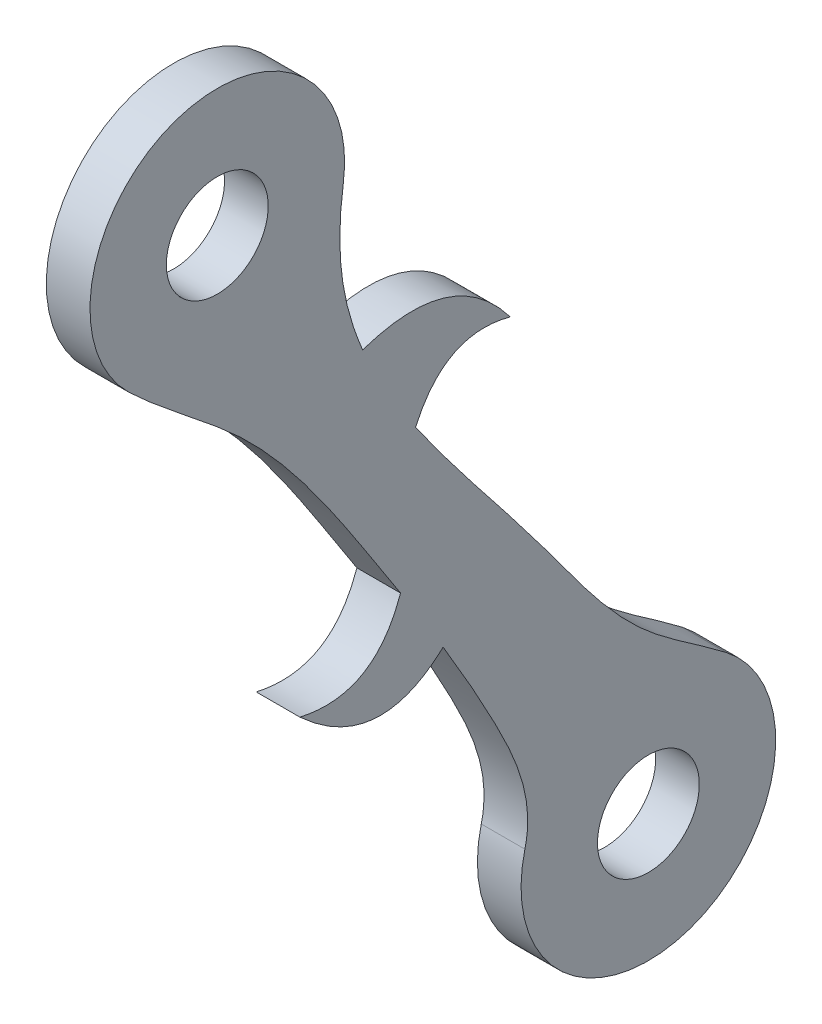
ISO-10303-21;
HEADER;
FILE_DESCRIPTION(('STEP AP214'),'2;1');
FILE_NAME('part.step','',(''),(''),'','','');
FILE_SCHEMA(('AUTOMOTIVE_DESIGN { 1 0 10303 214 1 1 1 1 }'));
ENDSEC;
DATA;
#1=APPLICATION_CONTEXT('core data for automotive mechanical design processes');
#2=APPLICATION_PROTOCOL_DEFINITION('international standard','automotive_design',2000,#1);
#3=PRODUCT_CONTEXT('',#1,'mechanical');
#4=PRODUCT('Part','Part','',(#3));
#5=PRODUCT_RELATED_PRODUCT_CATEGORY('part','',(#4));
#6=PRODUCT_DEFINITION_FORMATION('','',#4);
#7=PRODUCT_DEFINITION_CONTEXT('part definition',#1,'design');
#8=PRODUCT_DEFINITION('design','',#6,#7);
#9=PRODUCT_DEFINITION_SHAPE('','',#8);
#10=(LENGTH_UNIT() NAMED_UNIT(*) SI_UNIT(.MILLI.,.METRE.));
#11=(NAMED_UNIT(*) PLANE_ANGLE_UNIT() SI_UNIT($,.RADIAN.));
#12=(NAMED_UNIT(*) SI_UNIT($,.STERADIAN.) SOLID_ANGLE_UNIT());
#13=UNCERTAINTY_MEASURE_WITH_UNIT(LENGTH_MEASURE(1.E-05),#10,'distance_accuracy_value','');
#14=(GEOMETRIC_REPRESENTATION_CONTEXT(3) GLOBAL_UNCERTAINTY_ASSIGNED_CONTEXT((#13)) GLOBAL_UNIT_ASSIGNED_CONTEXT((#10,
#11,#12)) REPRESENTATION_CONTEXT('',''));
#15=CARTESIAN_POINT('',(0.,0.,0.));
#16=DIRECTION('',(0.,0.,1.));
#17=DIRECTION('',(1.,0.,0.));
#18=AXIS2_PLACEMENT_3D('',#15,#16,#17);
#19=CARTESIAN_POINT('',(-1.36819748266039,-0.277107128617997,67.7394060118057));
#20=CARTESIAN_POINT('',(-1.36819748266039,4.24847828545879,65.7155312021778));
#21=CARTESIAN_POINT('',(-1.36819748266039,3.03182089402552,61.2299207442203));
#22=B_SPLINE_CURVE_WITH_KNOTS('',2,(#19,#20,#21),.UNSPECIFIED.,.F.,.F.,(3,3),(0.,1.),.UNSPECIFIED.);
#23=DIRECTION('',(1.,0.,0.));
#24=VECTOR('',#23,1.);
#25=SURFACE_OF_LINEAR_EXTRUSION('',#22,#24);
#26=DIRECTION('',(-1.,0.,0.));
#27=VECTOR('',#26,1.);
#28=CARTESIAN_POINT('',(-1.36819748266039,3.03182089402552,61.2299207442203));
#29=LINE('',#28,#27);
#30=CARTESIAN_POINT('',(1.63180251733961,3.03182089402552,61.2299207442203));
#31=VERTEX_POINT('',#30);
#32=CARTESIAN_POINT('',(-1.36819748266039,3.03182089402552,61.2299207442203));
#33=VERTEX_POINT('',#32);
#34=EDGE_CURVE('E11',#31,#33,#29,.T.);
#35=ORIENTED_EDGE('',*,*,#34,.F.);
#36=CARTESIAN_POINT('',(1.63180251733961,-0.277107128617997,67.7394060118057));
#37=CARTESIAN_POINT('',(1.63180251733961,4.24847828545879,65.7155312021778));
#38=CARTESIAN_POINT('',(1.63180251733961,3.03182089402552,61.2299207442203));
#39=B_SPLINE_CURVE_WITH_KNOTS('',2,(#36,#37,#38),.UNSPECIFIED.,.F.,.F.,(3,3),(0.,1.),.UNSPECIFIED.);
#40=CARTESIAN_POINT('',(1.63180251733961,-0.27710712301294,67.7394060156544));
#41=VERTEX_POINT('',#40);
#42=EDGE_CURVE('E115',#41,#31,#39,.T.);
#43=ORIENTED_EDGE('',*,*,#42,.F.);
#44=DIRECTION('',(-1.,0.,0.));
#45=VECTOR('',#44,1.);
#46=CARTESIAN_POINT('',(-1.36819748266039,-0.27710712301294,67.7394060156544));
#47=LINE('',#46,#45);
#48=CARTESIAN_POINT('',(-1.36819748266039,-0.27710712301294,67.7394060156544));
#49=VERTEX_POINT('',#48);
#50=EDGE_CURVE('E52',#41,#49,#47,.T.);
#51=ORIENTED_EDGE('',*,*,#50,.T.);
#52=EDGE_CURVE('E210',#49,#33,#22,.T.);
#53=ORIENTED_EDGE('',*,*,#52,.T.);
#54=EDGE_LOOP('',(#35,#43,#51,#53));
#55=FACE_BOUND('',#54,.T.);
#56=ADVANCED_FACE('F41',(#55),#25,.T.);
#57=CARTESIAN_POINT('',(-1.36819748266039,16.6690822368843,72.7114555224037));
#58=CARTESIAN_POINT('',(-1.36819748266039,14.3923445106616,73.0487176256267));
#59=CARTESIAN_POINT('',(-1.36819748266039,7.94477005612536,72.9992097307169));
#60=CARTESIAN_POINT('',(-1.36819748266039,-1.71894822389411,67.1466798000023));
#61=CARTESIAN_POINT('',(-1.36819748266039,-10.9949276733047,59.275806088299));
#62=CARTESIAN_POINT('',(-1.36819748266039,-19.8573073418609,53.3835257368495));
#63=CARTESIAN_POINT('',(-1.36819748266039,-22.9678598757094,48.1902649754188));
#64=CARTESIAN_POINT('',(-1.36819748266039,-24.3590829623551,46.3908015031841));
#65=B_SPLINE_CURVE_WITH_KNOTS('',3,(#57,#58,#59,#60,#61,#62,#63,#64),.UNSPECIFIED.,.F.,.F.,(4,1,
1,1,1,4),(0.,0.13028049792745,0.385599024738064,0.63779392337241,0.868172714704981,1.),.UNSPECIFIED.);
#66=DIRECTION('',(1.,0.,0.));
#67=VECTOR('',#66,1.);
#68=SURFACE_OF_LINEAR_EXTRUSION('',#65,#67);
#69=ORIENTED_EDGE('',*,*,#50,.F.);
#70=CARTESIAN_POINT('',(1.63180251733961,16.6690822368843,72.7114555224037));
#71=CARTESIAN_POINT('',(1.63180251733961,14.3923445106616,73.0487176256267));
#72=CARTESIAN_POINT('',(1.63180251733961,7.94477005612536,72.9992097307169));
#73=CARTESIAN_POINT('',(1.63180251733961,-1.71894822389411,67.1466798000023));
#74=CARTESIAN_POINT('',(1.63180251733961,-10.9949276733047,59.275806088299));
#75=CARTESIAN_POINT('',(1.63180251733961,-19.8573073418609,53.3835257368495));
#76=CARTESIAN_POINT('',(1.63180251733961,-22.9678598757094,48.1902649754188));
#77=CARTESIAN_POINT('',(1.63180251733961,-24.3590829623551,46.3908015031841));
#78=B_SPLINE_CURVE_WITH_KNOTS('',3,(#70,#71,#72,#73,#74,#75,#76,#77),.UNSPECIFIED.,.F.,.F.,(4,1,
1,1,1,4),(0.,0.13028049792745,0.385599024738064,0.63779392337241,0.868172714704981,1.),.UNSPECIFIED.);
#79=CARTESIAN_POINT('',(1.63180251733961,-24.3590829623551,46.3908015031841));
#80=VERTEX_POINT('',#79);
#81=EDGE_CURVE('E169',#41,#80,#78,.T.);
#82=ORIENTED_EDGE('',*,*,#81,.T.);
#83=DIRECTION('',(-1.,0.,0.));
#84=VECTOR('',#83,1.);
#85=CARTESIAN_POINT('',(-1.36819748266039,-24.3590829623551,46.3908015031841));
#86=LINE('',#85,#84);
#87=CARTESIAN_POINT('',(-1.36819748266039,-24.3590829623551,46.3908015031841));
#88=VERTEX_POINT('',#87);
#89=EDGE_CURVE('E203',#80,#88,#86,.T.);
#90=ORIENTED_EDGE('',*,*,#89,.T.);
#91=EDGE_CURVE('E219',#49,#88,#65,.T.);
#92=ORIENTED_EDGE('',*,*,#91,.F.);
#93=EDGE_LOOP('',(#69,#82,#90,#92));
#94=FACE_BOUND('',#93,.T.);
#95=ADVANCED_FACE('F222',(#94),#68,.F.);
#96=CARTESIAN_POINT('',(-1.36819748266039,-31.2814704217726,51.7427218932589));
#97=DIRECTION('',(1.,0.,0.));
#98=DIRECTION('',(0.,0.,-1.));
#99=AXIS2_PLACEMENT_3D('',#96,#97,#98);
#100=CYLINDRICAL_SURFACE('',#99,8.74999999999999);
#101=ORIENTED_EDGE('',*,*,#89,.F.);
#102=CARTESIAN_POINT('',(1.63180251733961,-31.2814704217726,51.7427218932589));
#103=DIRECTION('',(1.,0.,0.));
#104=DIRECTION('',(0.,0.,-1.));
#105=AXIS2_PLACEMENT_3D('',#102,#103,#104);
#106=CIRCLE('',#105,8.74999999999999);
#107=CARTESIAN_POINT('',(1.63180251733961,-29.146619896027,60.2282927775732));
#108=VERTEX_POINT('',#107);
#109=EDGE_CURVE('E163',#108,#80,#106,.T.);
#110=ORIENTED_EDGE('',*,*,#109,.F.);
#111=DIRECTION('',(-1.,0.,0.));
#112=VECTOR('',#111,1.);
#113=CARTESIAN_POINT('',(-1.36819748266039,-29.146619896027,60.2282927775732));
#114=LINE('',#113,#112);
#115=CARTESIAN_POINT('',(-1.36819748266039,-29.146619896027,60.2282927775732));
#116=VERTEX_POINT('',#115);
#117=EDGE_CURVE('E200',#108,#116,#114,.T.);
#118=ORIENTED_EDGE('',*,*,#117,.T.);
#119=CARTESIAN_POINT('',(-1.36819748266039,-31.2814704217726,51.7427218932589));
#120=DIRECTION('',(1.,0.,0.));
#121=DIRECTION('',(0.,0.,-1.));
#122=AXIS2_PLACEMENT_3D('',#119,#120,#121);
#123=CIRCLE('',#122,8.74999999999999);
#124=EDGE_CURVE('E223',#116,#88,#123,.T.);
#125=ORIENTED_EDGE('',*,*,#124,.T.);
#126=EDGE_LOOP('',(#101,#110,#118,#125));
#127=FACE_BOUND('',#126,.T.);
#128=ADVANCED_FACE('F247',(#127),#100,.T.);
#129=CARTESIAN_POINT('',(-1.36819748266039,11.6562345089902,87.4444308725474));
#130=CARTESIAN_POINT('',(-1.36819748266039,9.3969173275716,85.104219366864));
#131=CARTESIAN_POINT('',(-1.36819748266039,4.62647087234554,78.0280257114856));
#132=CARTESIAN_POINT('',(-1.36819748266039,-7.14790080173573,70.3702869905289));
#133=CARTESIAN_POINT('',(-1.36819748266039,-17.8652193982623,63.4388504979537));
#134=CARTESIAN_POINT('',(-1.36819748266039,-26.2772710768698,59.506404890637));
#135=CARTESIAN_POINT('',(-1.36819748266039,-29.146619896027,60.2282927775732));
#136=B_SPLINE_CURVE_WITH_KNOTS('',3,(#129,#130,#131,#132,#133,#134,#135),.UNSPECIFIED.,.F.,.F.,
(4,1,1,1,4),(0.,0.197057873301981,0.503182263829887,0.820257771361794,1.),.UNSPECIFIED.);
#137=DIRECTION('',(1.,0.,0.));
#138=VECTOR('',#137,1.);
#139=SURFACE_OF_LINEAR_EXTRUSION('',#136,#138);
#140=ORIENTED_EDGE('',*,*,#117,.F.);
#141=CARTESIAN_POINT('',(1.63180251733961,11.6562345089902,87.4444308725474));
#142=CARTESIAN_POINT('',(1.63180251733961,9.3969173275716,85.104219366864));
#143=CARTESIAN_POINT('',(1.63180251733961,4.62647087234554,78.0280257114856));
#144=CARTESIAN_POINT('',(1.63180251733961,-7.14790080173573,70.3702869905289));
#145=CARTESIAN_POINT('',(1.63180251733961,-17.8652193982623,63.4388504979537));
#146=CARTESIAN_POINT('',(1.63180251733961,-26.2772710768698,59.506404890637));
#147=CARTESIAN_POINT('',(1.63180251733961,-29.146619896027,60.2282927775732));
#148=B_SPLINE_CURVE_WITH_KNOTS('',3,(#141,#142,#143,#144,#145,#146,#147),.UNSPECIFIED.,.F.,.F.,
(4,1,1,1,4),(0.,0.197057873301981,0.503182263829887,0.820257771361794,1.),.UNSPECIFIED.);
#149=CARTESIAN_POINT('',(1.63180251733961,-14.3131740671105,65.8485051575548));
#150=VERTEX_POINT('',#149);
#151=EDGE_CURVE('E155',#150,#108,#148,.T.);
#152=ORIENTED_EDGE('',*,*,#151,.F.);
#153=DIRECTION('',(-1.,0.,0.));
#154=VECTOR('',#153,1.);
#155=CARTESIAN_POINT('',(-1.36819748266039,-14.3131740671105,65.8485051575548));
#156=LINE('',#155,#154);
#157=CARTESIAN_POINT('',(-1.36819748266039,-14.3131740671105,65.8485051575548));
#158=VERTEX_POINT('',#157);
#159=EDGE_CURVE('E197',#150,#158,#156,.T.);
#160=ORIENTED_EDGE('',*,*,#159,.T.);
#161=EDGE_CURVE('E225',#158,#116,#136,.T.);
#162=ORIENTED_EDGE('',*,*,#161,.T.);
#163=EDGE_LOOP('',(#140,#152,#160,#162));
#164=FACE_BOUND('',#163,.T.);
#165=ADVANCED_FACE('F250',(#164),#139,.T.);
#166=CARTESIAN_POINT('',(-1.36819748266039,-13.5584162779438,75.6906477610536));
#167=CARTESIAN_POINT('',(-1.36819748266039,-18.4852301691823,70.3379966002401));
#168=CARTESIAN_POINT('',(-1.36819748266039,-14.3131740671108,65.8485051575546));
#169=B_SPLINE_CURVE_WITH_KNOTS('',2,(#166,#167,#168),.UNSPECIFIED.,.F.,.F.,(3,3),(0.,1.),.UNSPECIFIED.);
#170=DIRECTION('',(1.,0.,0.));
#171=VECTOR('',#170,1.);
#172=SURFACE_OF_LINEAR_EXTRUSION('',#169,#171);
#173=ORIENTED_EDGE('',*,*,#159,.F.);
#174=CARTESIAN_POINT('',(1.63180251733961,-13.5584162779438,75.6906477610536));
#175=CARTESIAN_POINT('',(1.63180251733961,-18.4852301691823,70.3379966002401));
#176=CARTESIAN_POINT('',(1.63180251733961,-14.3131740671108,65.8485051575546));
#177=B_SPLINE_CURVE_WITH_KNOTS('',2,(#174,#175,#176),.UNSPECIFIED.,.F.,.F.,(3,3),(0.,1.),.UNSPECIFIED.);
#178=CARTESIAN_POINT('',(1.63180251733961,-13.5584162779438,75.6906477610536));
#179=VERTEX_POINT('',#178);
#180=EDGE_CURVE('E147',#179,#150,#177,.T.);
#181=ORIENTED_EDGE('',*,*,#180,.F.);
#182=DIRECTION('',(-1.,0.,0.));
#183=VECTOR('',#182,1.);
#184=CARTESIAN_POINT('',(-1.36819748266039,-13.5584162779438,75.6906477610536));
#185=LINE('',#184,#183);
#186=CARTESIAN_POINT('',(-1.36819748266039,-13.5584162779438,75.6906477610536));
#187=VERTEX_POINT('',#186);
#188=EDGE_CURVE('E194',#179,#187,#185,.T.);
#189=ORIENTED_EDGE('',*,*,#188,.T.);
#190=EDGE_CURVE('E259',#187,#158,#169,.T.);
#191=ORIENTED_EDGE('',*,*,#190,.T.);
#192=EDGE_LOOP('',(#173,#181,#189,#191));
#193=FACE_BOUND('',#192,.T.);
#194=ADVANCED_FACE('F252',(#193),#172,.T.);
#195=CARTESIAN_POINT('',(-1.36819748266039,-9.63323260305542,68.7729174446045));
#196=CARTESIAN_POINT('',(-1.36819748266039,-14.7201151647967,70.5639251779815));
#197=CARTESIAN_POINT('',(-1.36819748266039,-13.5584162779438,75.6906477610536));
#198=B_SPLINE_CURVE_WITH_KNOTS('',2,(#195,#196,#197),.UNSPECIFIED.,.F.,.F.,(3,3),(0.,1.),.UNSPECIFIED.);
#199=DIRECTION('',(1.,0.,0.));
#200=VECTOR('',#199,1.);
#201=SURFACE_OF_LINEAR_EXTRUSION('',#198,#200);
#202=ORIENTED_EDGE('',*,*,#188,.F.);
#203=CARTESIAN_POINT('',(1.63180251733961,-9.63323260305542,68.7729174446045));
#204=CARTESIAN_POINT('',(1.63180251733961,-14.7201151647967,70.5639251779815));
#205=CARTESIAN_POINT('',(1.63180251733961,-13.5584162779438,75.6906477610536));
#206=B_SPLINE_CURVE_WITH_KNOTS('',2,(#203,#204,#205),.UNSPECIFIED.,.F.,.F.,(3,3),(0.,1.),.UNSPECIFIED.);
#207=CARTESIAN_POINT('',(1.63180251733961,-9.63323261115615,68.7729174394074));
#208=VERTEX_POINT('',#207);
#209=EDGE_CURVE('E139',#208,#179,#206,.T.);
#210=ORIENTED_EDGE('',*,*,#209,.F.);
#211=DIRECTION('',(-1.,0.,0.));
#212=VECTOR('',#211,1.);
#213=CARTESIAN_POINT('',(-1.36819748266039,-9.63323261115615,68.7729174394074));
#214=LINE('',#213,#212);
#215=CARTESIAN_POINT('',(-1.36819748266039,-9.63323261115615,68.7729174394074));
#216=VERTEX_POINT('',#215);
#217=EDGE_CURVE('E191',#208,#216,#214,.T.);
#218=ORIENTED_EDGE('',*,*,#217,.T.);
#219=EDGE_CURVE('E264',#216,#187,#198,.T.);
#220=ORIENTED_EDGE('',*,*,#219,.T.);
#221=EDGE_LOOP('',(#202,#210,#218,#220));
#222=FACE_BOUND('',#221,.T.);
#223=ADVANCED_FACE('F256',(#222),#201,.T.);
#224=ORIENTED_EDGE('',*,*,#217,.F.);
#225=CARTESIAN_POINT('',(1.63180251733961,11.6562345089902,87.4444308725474));
#226=CARTESIAN_POINT('',(1.63180251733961,9.3969173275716,85.104219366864));
#227=CARTESIAN_POINT('',(1.63180251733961,4.62647087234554,78.0280257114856));
#228=CARTESIAN_POINT('',(1.63180251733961,-7.14790080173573,70.3702869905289));
#229=CARTESIAN_POINT('',(1.63180251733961,-17.8652193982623,63.4388504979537));
#230=CARTESIAN_POINT('',(1.63180251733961,-26.2772710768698,59.506404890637));
#231=CARTESIAN_POINT('',(1.63180251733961,-29.146619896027,60.2282927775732));
#232=B_SPLINE_CURVE_WITH_KNOTS('',3,(#225,#226,#227,#228,#229,#230,#231),.UNSPECIFIED.,.F.,.F.,
(4,1,1,1,4),(0.,0.197057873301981,0.503182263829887,0.820257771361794,1.),.UNSPECIFIED.);
#233=CARTESIAN_POINT('',(1.63180251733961,11.6562345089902,87.4444308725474));
#234=VERTEX_POINT('',#233);
#235=EDGE_CURVE('E134',#234,#208,#232,.T.);
#236=ORIENTED_EDGE('',*,*,#235,.F.);
#237=DIRECTION('',(-1.,0.,0.));
#238=VECTOR('',#237,1.);
#239=CARTESIAN_POINT('',(-1.36819748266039,11.6562345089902,87.4444308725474));
#240=LINE('',#239,#238);
#241=CARTESIAN_POINT('',(-1.36819748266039,11.6562345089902,87.4444308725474));
#242=VERTEX_POINT('',#241);
#243=EDGE_CURVE('E189',#234,#242,#240,.T.);
#244=ORIENTED_EDGE('',*,*,#243,.T.);
#245=EDGE_CURVE('E275',#242,#216,#136,.T.);
#246=ORIENTED_EDGE('',*,*,#245,.T.);
#247=EDGE_LOOP('',(#224,#236,#244,#246));
#248=FACE_BOUND('',#247,.T.);
#249=ADVANCED_FACE('F298',(#248),#139,.T.);
#250=CARTESIAN_POINT('',(-1.36819748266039,17.9512625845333,81.3670036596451));
#251=DIRECTION('',(1.,0.,0.));
#252=DIRECTION('',(0.,0.,-1.));
#253=AXIS2_PLACEMENT_3D('',#250,#251,#252);
#254=CYLINDRICAL_SURFACE('',#253,8.75);
#255=ORIENTED_EDGE('',*,*,#243,.F.);
#256=CARTESIAN_POINT('',(1.63180251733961,17.9512625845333,81.3670036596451));
#257=DIRECTION('',(1.,0.,0.));
#258=DIRECTION('',(0.,0.,-1.));
#259=AXIS2_PLACEMENT_3D('',#256,#257,#258);
#260=CIRCLE('',#259,8.75);
#261=CARTESIAN_POINT('',(1.63180251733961,16.6690822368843,72.7114555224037));
#262=VERTEX_POINT('',#261);
#263=EDGE_CURVE('E128',#262,#234,#260,.T.);
#264=ORIENTED_EDGE('',*,*,#263,.F.);
#265=DIRECTION('',(-1.,0.,0.));
#266=VECTOR('',#265,1.);
#267=CARTESIAN_POINT('',(-1.36819748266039,16.6690822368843,72.7114555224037));
#268=LINE('',#267,#266);
#269=CARTESIAN_POINT('',(-1.36819748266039,16.6690822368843,72.7114555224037));
#270=VERTEX_POINT('',#269);
#271=EDGE_CURVE('E60',#262,#270,#268,.T.);
#272=ORIENTED_EDGE('',*,*,#271,.T.);
#273=CARTESIAN_POINT('',(-1.36819748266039,17.9512625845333,81.3670036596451));
#274=DIRECTION('',(1.,0.,0.));
#275=DIRECTION('',(0.,0.,-1.));
#276=AXIS2_PLACEMENT_3D('',#273,#274,#275);
#277=CIRCLE('',#276,8.75);
#278=EDGE_CURVE('E108',#270,#242,#277,.T.);
#279=ORIENTED_EDGE('',*,*,#278,.T.);
#280=EDGE_LOOP('',(#255,#264,#272,#279));
#281=FACE_BOUND('',#280,.T.);
#282=ADVANCED_FACE('F299',(#281),#254,.T.);
#283=ORIENTED_EDGE('',*,*,#271,.F.);
#284=CARTESIAN_POINT('',(1.63180251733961,16.6690822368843,72.7114555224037));
#285=CARTESIAN_POINT('',(1.63180251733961,14.3923445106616,73.0487176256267));
#286=CARTESIAN_POINT('',(1.63180251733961,7.94477005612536,72.9992097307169));
#287=CARTESIAN_POINT('',(1.63180251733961,-1.71894822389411,67.1466798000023));
#288=CARTESIAN_POINT('',(1.63180251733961,-10.9949276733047,59.275806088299));
#289=CARTESIAN_POINT('',(1.63180251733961,-19.8573073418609,53.3835257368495));
#290=CARTESIAN_POINT('',(1.63180251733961,-22.9678598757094,48.1902649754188));
#291=CARTESIAN_POINT('',(1.63180251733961,-24.3590829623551,46.3908015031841));
#292=B_SPLINE_CURVE_WITH_KNOTS('',3,(#284,#285,#286,#287,#288,#289,#290,#291),.UNSPECIFIED.,.F.,
.F.,(4,1,1,1,1,4),(0.,0.13028049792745,0.385599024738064,0.63779392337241,0.868172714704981,1.),.UNSPECIFIED.);
#293=CARTESIAN_POINT('',(1.63180251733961,6.13319627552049,71.3738018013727));
#294=VERTEX_POINT('',#293);
#295=EDGE_CURVE('E113',#262,#294,#292,.T.);
#296=ORIENTED_EDGE('',*,*,#295,.T.);
#297=DIRECTION('',(-1.,0.,0.));
#298=VECTOR('',#297,1.);
#299=CARTESIAN_POINT('',(-1.36819748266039,6.13319627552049,71.3738018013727));
#300=LINE('',#299,#298);
#301=CARTESIAN_POINT('',(-1.36819748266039,6.13319627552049,71.3738018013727));
#302=VERTEX_POINT('',#301);
#303=EDGE_CURVE('E46',#294,#302,#300,.T.);
#304=ORIENTED_EDGE('',*,*,#303,.T.);
#305=EDGE_CURVE('E133',#270,#302,#65,.T.);
#306=ORIENTED_EDGE('',*,*,#305,.F.);
#307=EDGE_LOOP('',(#283,#296,#304,#306));
#308=FACE_BOUND('',#307,.T.);
#309=ADVANCED_FACE('F117',(#308),#68,.F.);
#310=CARTESIAN_POINT('',(-1.36819748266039,3.03182089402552,61.2299207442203));
#311=CARTESIAN_POINT('',(-1.36819748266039,8.26601820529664,65.2031793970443));
#312=CARTESIAN_POINT('',(-1.36819748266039,6.13319627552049,71.3738018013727));
#313=B_SPLINE_CURVE_WITH_KNOTS('',2,(#310,#311,#312),.UNSPECIFIED.,.F.,.F.,(3,3),(0.,1.),.UNSPECIFIED.);
#314=DIRECTION('',(1.,0.,0.));
#315=VECTOR('',#314,1.);
#316=SURFACE_OF_LINEAR_EXTRUSION('',#313,#315);
#317=CARTESIAN_POINT('',(1.63180251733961,3.03182089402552,61.2299207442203));
#318=CARTESIAN_POINT('',(1.63180251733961,8.26601820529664,65.2031793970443));
#319=CARTESIAN_POINT('',(1.63180251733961,6.13319627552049,71.3738018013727));
#320=B_SPLINE_CURVE_WITH_KNOTS('',2,(#317,#318,#319),.UNSPECIFIED.,.F.,.F.,(3,3),(0.,1.),.UNSPECIFIED.);
#321=EDGE_CURVE('E102',#31,#294,#320,.T.);
#322=ORIENTED_EDGE('',*,*,#321,.F.);
#323=ORIENTED_EDGE('',*,*,#34,.T.);
#324=EDGE_CURVE('E104',#33,#302,#313,.T.);
#325=ORIENTED_EDGE('',*,*,#324,.T.);
#326=ORIENTED_EDGE('',*,*,#303,.F.);
#327=EDGE_LOOP('',(#322,#323,#325,#326));
#328=FACE_BOUND('',#327,.T.);
#329=ADVANCED_FACE('F43',(#328),#316,.T.);
#330=CARTESIAN_POINT('',(-1.36819748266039,3.03182089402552,-30.5936564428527));
#331=DIRECTION('',(1.,0.,0.));
#332=DIRECTION('',(0.,0.,-1.));
#333=AXIS2_PLACEMENT_3D('',#330,#331,#332);
#334=PLANE('',#333);
#335=CARTESIAN_POINT('',(-1.36819748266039,-31.2814704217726,51.7427218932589));
#336=DIRECTION('',(-1.,0.,0.));
#337=DIRECTION('',(0.,0.,1.));
#338=AXIS2_PLACEMENT_3D('',#335,#336,#337);
#339=CIRCLE('',#338,3.5);
#340=CARTESIAN_POINT('',(-1.36819748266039,-31.2814704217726,55.2427218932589));
#341=VERTEX_POINT('',#340);
#342=EDGE_CURVE('E329',#341,#341,#339,.T.);
#343=ORIENTED_EDGE('',*,*,#342,.F.);
#344=EDGE_LOOP('',(#343));
#345=FACE_BOUND('',#344,.T.);
#346=CARTESIAN_POINT('',(-1.36819748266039,17.9512625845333,81.3670036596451));
#347=DIRECTION('',(-1.,0.,0.));
#348=DIRECTION('',(0.,0.,1.));
#349=AXIS2_PLACEMENT_3D('',#346,#347,#348);
#350=CIRCLE('',#349,3.50000000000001);
#351=CARTESIAN_POINT('',(-1.36819748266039,17.9512625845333,84.8670036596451));
#352=VERTEX_POINT('',#351);
#353=EDGE_CURVE('E121',#352,#352,#350,.T.);
#354=ORIENTED_EDGE('',*,*,#353,.F.);
#355=EDGE_LOOP('',(#354));
#356=FACE_BOUND('',#355,.T.);
#357=ORIENTED_EDGE('',*,*,#305,.T.);
#358=ORIENTED_EDGE('',*,*,#324,.F.);
#359=ORIENTED_EDGE('',*,*,#52,.F.);
#360=ORIENTED_EDGE('',*,*,#91,.T.);
#361=ORIENTED_EDGE('',*,*,#124,.F.);
#362=ORIENTED_EDGE('',*,*,#161,.F.);
#363=ORIENTED_EDGE('',*,*,#190,.F.);
#364=ORIENTED_EDGE('',*,*,#219,.F.);
#365=ORIENTED_EDGE('',*,*,#245,.F.);
#366=ORIENTED_EDGE('',*,*,#278,.F.);
#367=EDGE_LOOP('',(#357,#358,#359,#360,#361,#362,#363,#364,#365,#366));
#368=FACE_BOUND('',#367,.T.);
#369=ADVANCED_FACE('F217',(#345,#356,#368),#334,.F.);
#370=CARTESIAN_POINT('',(1.63180251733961,3.03182089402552,-30.5936564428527));
#371=DIRECTION('',(1.,0.,0.));
#372=DIRECTION('',(0.,0.,-1.));
#373=AXIS2_PLACEMENT_3D('',#370,#371,#372);
#374=PLANE('',#373);
#375=CARTESIAN_POINT('',(1.63180251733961,-31.2814704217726,51.7427218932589));
#376=DIRECTION('',(-1.,0.,0.));
#377=DIRECTION('',(0.,0.,1.));
#378=AXIS2_PLACEMENT_3D('',#375,#376,#377);
#379=CIRCLE('',#378,3.5);
#380=CARTESIAN_POINT('',(1.63180251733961,-31.2814704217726,55.2427218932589));
#381=VERTEX_POINT('',#380);
#382=EDGE_CURVE('E326',#381,#381,#379,.T.);
#383=ORIENTED_EDGE('',*,*,#382,.T.);
#384=EDGE_LOOP('',(#383));
#385=FACE_BOUND('',#384,.T.);
#386=CARTESIAN_POINT('',(1.63180251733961,17.9512625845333,81.3670036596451));
#387=DIRECTION('',(-1.,0.,0.));
#388=DIRECTION('',(0.,0.,1.));
#389=AXIS2_PLACEMENT_3D('',#386,#387,#388);
#390=CIRCLE('',#389,3.50000000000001);
#391=CARTESIAN_POINT('',(1.63180251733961,17.9512625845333,84.8670036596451));
#392=VERTEX_POINT('',#391);
#393=EDGE_CURVE('E118',#392,#392,#390,.T.);
#394=ORIENTED_EDGE('',*,*,#393,.T.);
#395=EDGE_LOOP('',(#394));
#396=FACE_BOUND('',#395,.T.);
#397=ORIENTED_EDGE('',*,*,#295,.F.);
#398=ORIENTED_EDGE('',*,*,#263,.T.);
#399=ORIENTED_EDGE('',*,*,#235,.T.);
#400=ORIENTED_EDGE('',*,*,#209,.T.);
#401=ORIENTED_EDGE('',*,*,#180,.T.);
#402=ORIENTED_EDGE('',*,*,#151,.T.);
#403=ORIENTED_EDGE('',*,*,#109,.T.);
#404=ORIENTED_EDGE('',*,*,#81,.F.);
#405=ORIENTED_EDGE('',*,*,#42,.T.);
#406=ORIENTED_EDGE('',*,*,#321,.T.);
#407=EDGE_LOOP('',(#397,#398,#399,#400,#401,#402,#403,#404,#405,#406));
#408=FACE_BOUND('',#407,.T.);
#409=ADVANCED_FACE('F111',(#385,#396,#408),#374,.T.);
#410=CARTESIAN_POINT('',(1.63180251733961,17.9512625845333,81.3670036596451));
#411=DIRECTION('',(-1.,0.,0.));
#412=DIRECTION('',(0.,0.,1.));
#413=AXIS2_PLACEMENT_3D('',#410,#411,#412);
#414=CYLINDRICAL_SURFACE('',#413,3.50000000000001);
#415=ORIENTED_EDGE('',*,*,#393,.F.);
#416=EDGE_LOOP('',(#415));
#417=FACE_BOUND('',#416,.T.);
#418=ORIENTED_EDGE('',*,*,#353,.T.);
#419=EDGE_LOOP('',(#418));
#420=FACE_BOUND('',#419,.T.);
#421=ADVANCED_FACE('F310',(#417,#420),#414,.F.);
#422=CARTESIAN_POINT('',(1.63180251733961,-31.2814704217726,51.7427218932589));
#423=DIRECTION('',(-1.,0.,0.));
#424=DIRECTION('',(0.,0.,1.));
#425=AXIS2_PLACEMENT_3D('',#422,#423,#424);
#426=CYLINDRICAL_SURFACE('',#425,3.5);
#427=ORIENTED_EDGE('',*,*,#382,.F.);
#428=EDGE_LOOP('',(#427));
#429=FACE_BOUND('',#428,.T.);
#430=ORIENTED_EDGE('',*,*,#342,.T.);
#431=EDGE_LOOP('',(#430));
#432=FACE_BOUND('',#431,.T.);
#433=ADVANCED_FACE('F317',(#429,#432),#426,.F.);
#434=CLOSED_SHELL('',(#56,#95,#128,#165,#194,#223,#249,#282,#309,#329,#369,#409,#421,#433));
#435=MANIFOLD_SOLID_BREP('B2',#434);
#436=ADVANCED_BREP_SHAPE_REPRESENTATION('',(#18,#435),#14);
#437=SHAPE_DEFINITION_REPRESENTATION(#9,#436);
ENDSEC;
END-ISO-10303-21;
